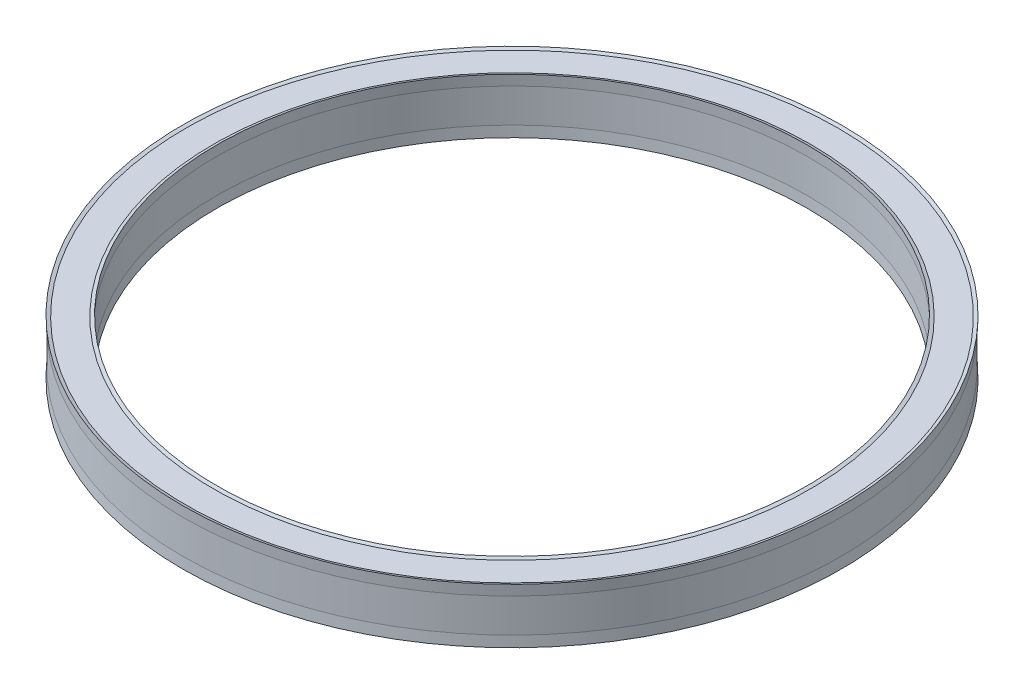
ISO-10303-21;
HEADER;
FILE_DESCRIPTION(('STEP AP214'),'2;1');
FILE_NAME('part.step','',(''),(''),'','','');
FILE_SCHEMA(('AUTOMOTIVE_DESIGN { 1 0 10303 214 1 1 1 1 }'));
ENDSEC;
DATA;
#1=APPLICATION_CONTEXT('core data for automotive mechanical design processes');
#2=APPLICATION_PROTOCOL_DEFINITION('international standard','automotive_design',2000,#1);
#3=PRODUCT_CONTEXT('',#1,'mechanical');
#4=PRODUCT('Part','Part','',(#3));
#5=PRODUCT_RELATED_PRODUCT_CATEGORY('part','',(#4));
#6=PRODUCT_DEFINITION_FORMATION('','',#4);
#7=PRODUCT_DEFINITION_CONTEXT('part definition',#1,'design');
#8=PRODUCT_DEFINITION('design','',#6,#7);
#9=PRODUCT_DEFINITION_SHAPE('','',#8);
#10=(LENGTH_UNIT() NAMED_UNIT(*) SI_UNIT(.MILLI.,.METRE.));
#11=(NAMED_UNIT(*) PLANE_ANGLE_UNIT() SI_UNIT($,.RADIAN.));
#12=(NAMED_UNIT(*) SI_UNIT($,.STERADIAN.) SOLID_ANGLE_UNIT());
#13=UNCERTAINTY_MEASURE_WITH_UNIT(LENGTH_MEASURE(1.E-05),#10,'distance_accuracy_value','');
#14=(GEOMETRIC_REPRESENTATION_CONTEXT(3) GLOBAL_UNCERTAINTY_ASSIGNED_CONTEXT((#13)) GLOBAL_UNIT_ASSIGNED_CONTEXT((#10,
#11,#12)) REPRESENTATION_CONTEXT('',''));
#15=CARTESIAN_POINT('',(0.,0.,0.));
#16=DIRECTION('',(0.,0.,1.));
#17=DIRECTION('',(1.,0.,0.));
#18=AXIS2_PLACEMENT_3D('',#15,#16,#17);
#19=CARTESIAN_POINT('',(0.,6.223,0.));
#20=DIRECTION('',(0.,-1.,0.));
#21=DIRECTION('',(0.,0.,-1.));
#22=AXIS2_PLACEMENT_3D('',#19,#20,#21);
#23=CONICAL_SURFACE('',#22,34.51225,1.24904577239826);
#24=CARTESIAN_POINT('',(0.,6.35,0.));
#25=DIRECTION('',(0.,-1.,0.));
#26=DIRECTION('',(0.,0.,-1.));
#27=AXIS2_PLACEMENT_3D('',#24,#25,#26);
#28=CIRCLE('',#27,34.13125);
#29=CARTESIAN_POINT('',(0.,6.35,-34.13125));
#30=VERTEX_POINT('',#29);
#31=EDGE_CURVE('E68',#30,#30,#28,.T.);
#32=ORIENTED_EDGE('',*,*,#31,.T.);
#33=EDGE_LOOP('',(#32));
#34=FACE_BOUND('',#33,.T.);
#35=CARTESIAN_POINT('',(0.,6.223,0.));
#36=DIRECTION('',(0.,-1.,0.));
#37=DIRECTION('',(0.,0.,-1.));
#38=AXIS2_PLACEMENT_3D('',#35,#36,#37);
#39=CIRCLE('',#38,34.51225);
#40=CARTESIAN_POINT('',(0.,6.223,-34.51225));
#41=VERTEX_POINT('',#40);
#42=EDGE_CURVE('E10',#41,#41,#39,.T.);
#43=ORIENTED_EDGE('',*,*,#42,.F.);
#44=EDGE_LOOP('',(#43));
#45=FACE_BOUND('',#44,.T.);
#46=ADVANCED_FACE('F28',(#34,#45),#23,.T.);
#47=CARTESIAN_POINT('',(34.51225,6.223,0.));
#48=DIRECTION('',(0.,1.,0.));
#49=DIRECTION('',(0.,0.,1.));
#50=AXIS2_PLACEMENT_3D('',#47,#48,#49);
#51=PLANE('',#50);
#52=ORIENTED_EDGE('',*,*,#42,.T.);
#53=EDGE_LOOP('',(#52));
#54=FACE_BOUND('',#53,.T.);
#55=CARTESIAN_POINT('',(0.,6.223,0.));
#56=DIRECTION('',(0.,-1.,0.));
#57=DIRECTION('',(0.,0.,-1.));
#58=AXIS2_PLACEMENT_3D('',#55,#56,#57);
#59=CIRCLE('',#58,37.719);
#60=CARTESIAN_POINT('',(0.,6.223,-37.719));
#61=VERTEX_POINT('',#60);
#62=EDGE_CURVE('E34',#61,#61,#59,.T.);
#63=ORIENTED_EDGE('',*,*,#62,.F.);
#64=EDGE_LOOP('',(#63));
#65=FACE_BOUND('',#64,.T.);
#66=ADVANCED_FACE('F86',(#54,#65),#51,.T.);
#67=CARTESIAN_POINT('',(0.,6.35,0.));
#68=DIRECTION('',(0.,1.,0.));
#69=DIRECTION('',(0.,0.,1.));
#70=AXIS2_PLACEMENT_3D('',#67,#68,#69);
#71=CONICAL_SURFACE('',#70,38.1,1.24904577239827);
#72=ORIENTED_EDGE('',*,*,#62,.T.);
#73=EDGE_LOOP('',(#72));
#74=FACE_BOUND('',#73,.T.);
#75=CARTESIAN_POINT('',(0.,6.35,0.));
#76=DIRECTION('',(0.,-1.,0.));
#77=DIRECTION('',(0.,0.,-1.));
#78=AXIS2_PLACEMENT_3D('',#75,#76,#77);
#79=CIRCLE('',#78,38.1);
#80=CARTESIAN_POINT('',(0.,6.35,-38.1));
#81=VERTEX_POINT('',#80);
#82=EDGE_CURVE('E38',#81,#81,#79,.T.);
#83=ORIENTED_EDGE('',*,*,#82,.F.);
#84=EDGE_LOOP('',(#83));
#85=FACE_BOUND('',#84,.T.);
#86=ADVANCED_FACE('F90',(#74,#85),#71,.F.);
#87=CARTESIAN_POINT('',(0.,5.1308,0.));
#88=DIRECTION('',(0.,1.,0.));
#89=DIRECTION('',(0.,0.,1.));
#90=AXIS2_PLACEMENT_3D('',#87,#88,#89);
#91=CONICAL_SURFACE('',#90,38.0365,0.0520363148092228);
#92=ORIENTED_EDGE('',*,*,#82,.T.);
#93=EDGE_LOOP('',(#92));
#94=FACE_BOUND('',#93,.T.);
#95=CARTESIAN_POINT('',(0.,5.1308,0.));
#96=DIRECTION('',(0.,-1.,0.));
#97=DIRECTION('',(0.,0.,-1.));
#98=AXIS2_PLACEMENT_3D('',#95,#96,#97);
#99=CIRCLE('',#98,38.0365);
#100=CARTESIAN_POINT('',(0.,5.1308,-38.0365));
#101=VERTEX_POINT('',#100);
#102=EDGE_CURVE('E42',#101,#101,#99,.T.);
#103=ORIENTED_EDGE('',*,*,#102,.F.);
#104=EDGE_LOOP('',(#103));
#105=FACE_BOUND('',#104,.T.);
#106=ADVANCED_FACE('F94',(#94,#105),#91,.T.);
#107=CARTESIAN_POINT('',(0.,0.,0.));
#108=DIRECTION('',(0.,-1.,0.));
#109=DIRECTION('',(0.,0.,-1.));
#110=AXIS2_PLACEMENT_3D('',#107,#108,#109);
#111=CYLINDRICAL_SURFACE('',#110,38.0365);
#112=ORIENTED_EDGE('',*,*,#102,.T.);
#113=EDGE_LOOP('',(#112));
#114=FACE_BOUND('',#113,.T.);
#115=CARTESIAN_POINT('',(0.,1.2192,0.));
#116=DIRECTION('',(0.,-1.,0.));
#117=DIRECTION('',(0.,0.,-1.));
#118=AXIS2_PLACEMENT_3D('',#115,#116,#117);
#119=CIRCLE('',#118,38.0365);
#120=CARTESIAN_POINT('',(0.,1.2192,-38.0365));
#121=VERTEX_POINT('',#120);
#122=EDGE_CURVE('E47',#121,#121,#119,.T.);
#123=ORIENTED_EDGE('',*,*,#122,.F.);
#124=EDGE_LOOP('',(#123));
#125=FACE_BOUND('',#124,.T.);
#126=ADVANCED_FACE('F100',(#114,#125),#111,.T.);
#127=CARTESIAN_POINT('',(0.,0.,0.));
#128=DIRECTION('',(0.,-1.,0.));
#129=DIRECTION('',(0.,0.,-1.));
#130=AXIS2_PLACEMENT_3D('',#127,#128,#129);
#131=CONICAL_SURFACE('',#130,38.1,0.0520363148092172);
#132=ORIENTED_EDGE('',*,*,#122,.T.);
#133=EDGE_LOOP('',(#132));
#134=FACE_BOUND('',#133,.T.);
#135=CARTESIAN_POINT('',(0.,0.,0.));
#136=DIRECTION('',(0.,-1.,0.));
#137=DIRECTION('',(0.,0.,-1.));
#138=AXIS2_PLACEMENT_3D('',#135,#136,#137);
#139=CIRCLE('',#138,38.1);
#140=CARTESIAN_POINT('',(0.,0.,-38.1));
#141=VERTEX_POINT('',#140);
#142=EDGE_CURVE('E50',#141,#141,#139,.T.);
#143=ORIENTED_EDGE('',*,*,#142,.F.);
#144=EDGE_LOOP('',(#143));
#145=FACE_BOUND('',#144,.T.);
#146=ADVANCED_FACE('F104',(#134,#145),#131,.T.);
#147=CARTESIAN_POINT('',(0.,0.127,0.));
#148=DIRECTION('',(0.,-1.,0.));
#149=DIRECTION('',(0.,0.,-1.));
#150=AXIS2_PLACEMENT_3D('',#147,#148,#149);
#151=CONICAL_SURFACE('',#150,37.719,1.24904577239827);
#152=ORIENTED_EDGE('',*,*,#142,.T.);
#153=EDGE_LOOP('',(#152));
#154=FACE_BOUND('',#153,.T.);
#155=CARTESIAN_POINT('',(0.,0.127,0.));
#156=DIRECTION('',(0.,-1.,0.));
#157=DIRECTION('',(0.,0.,-1.));
#158=AXIS2_PLACEMENT_3D('',#155,#156,#157);
#159=CIRCLE('',#158,37.719);
#160=CARTESIAN_POINT('',(0.,0.127,-37.719));
#161=VERTEX_POINT('',#160);
#162=EDGE_CURVE('E53',#161,#161,#159,.T.);
#163=ORIENTED_EDGE('',*,*,#162,.F.);
#164=EDGE_LOOP('',(#163));
#165=FACE_BOUND('',#164,.T.);
#166=ADVANCED_FACE('F108',(#154,#165),#151,.F.);
#167=CARTESIAN_POINT('',(34.51225,0.127,0.));
#168=DIRECTION('',(0.,-1.,0.));
#169=DIRECTION('',(0.,0.,-1.));
#170=AXIS2_PLACEMENT_3D('',#167,#168,#169);
#171=PLANE('',#170);
#172=ORIENTED_EDGE('',*,*,#162,.T.);
#173=EDGE_LOOP('',(#172));
#174=FACE_BOUND('',#173,.T.);
#175=CARTESIAN_POINT('',(0.,0.127,0.));
#176=DIRECTION('',(0.,-1.,0.));
#177=DIRECTION('',(0.,0.,-1.));
#178=AXIS2_PLACEMENT_3D('',#175,#176,#177);
#179=CIRCLE('',#178,34.51225);
#180=CARTESIAN_POINT('',(0.,0.127,-34.51225));
#181=VERTEX_POINT('',#180);
#182=EDGE_CURVE('E56',#181,#181,#179,.T.);
#183=ORIENTED_EDGE('',*,*,#182,.F.);
#184=EDGE_LOOP('',(#183));
#185=FACE_BOUND('',#184,.T.);
#186=ADVANCED_FACE('F112',(#174,#185),#171,.T.);
#187=CARTESIAN_POINT('',(0.,0.,0.));
#188=DIRECTION('',(0.,1.,0.));
#189=DIRECTION('',(0.,0.,1.));
#190=AXIS2_PLACEMENT_3D('',#187,#188,#189);
#191=CONICAL_SURFACE('',#190,34.13125,1.24904577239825);
#192=ORIENTED_EDGE('',*,*,#182,.T.);
#193=EDGE_LOOP('',(#192));
#194=FACE_BOUND('',#193,.T.);
#195=CARTESIAN_POINT('',(0.,0.,0.));
#196=DIRECTION('',(0.,-1.,0.));
#197=DIRECTION('',(0.,0.,-1.));
#198=AXIS2_PLACEMENT_3D('',#195,#196,#197);
#199=CIRCLE('',#198,34.13125);
#200=CARTESIAN_POINT('',(0.,0.,-34.13125));
#201=VERTEX_POINT('',#200);
#202=EDGE_CURVE('E59',#201,#201,#199,.T.);
#203=ORIENTED_EDGE('',*,*,#202,.F.);
#204=EDGE_LOOP('',(#203));
#205=FACE_BOUND('',#204,.T.);
#206=ADVANCED_FACE('F116',(#194,#205),#191,.T.);
#207=CARTESIAN_POINT('',(0.,1.2192,0.));
#208=DIRECTION('',(0.,1.,0.));
#209=DIRECTION('',(0.,0.,1.));
#210=AXIS2_PLACEMENT_3D('',#207,#208,#209);
#211=CONICAL_SURFACE('',#210,34.19475,0.0520363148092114);
#212=ORIENTED_EDGE('',*,*,#202,.T.);
#213=EDGE_LOOP('',(#212));
#214=FACE_BOUND('',#213,.T.);
#215=CARTESIAN_POINT('',(0.,1.2192,0.));
#216=DIRECTION('',(0.,-1.,0.));
#217=DIRECTION('',(0.,0.,-1.));
#218=AXIS2_PLACEMENT_3D('',#215,#216,#217);
#219=CIRCLE('',#218,34.19475);
#220=CARTESIAN_POINT('',(0.,1.2192,-34.19475));
#221=VERTEX_POINT('',#220);
#222=EDGE_CURVE('E62',#221,#221,#219,.T.);
#223=ORIENTED_EDGE('',*,*,#222,.F.);
#224=EDGE_LOOP('',(#223));
#225=FACE_BOUND('',#224,.T.);
#226=ADVANCED_FACE('F82',(#214,#225),#211,.F.);
#227=CARTESIAN_POINT('',(0.,0.,0.));
#228=DIRECTION('',(0.,-1.,0.));
#229=DIRECTION('',(0.,0.,-1.));
#230=AXIS2_PLACEMENT_3D('',#227,#228,#229);
#231=CYLINDRICAL_SURFACE('',#230,34.19475);
#232=ORIENTED_EDGE('',*,*,#222,.T.);
#233=EDGE_LOOP('',(#232));
#234=FACE_BOUND('',#233,.T.);
#235=CARTESIAN_POINT('',(0.,5.1308,0.));
#236=DIRECTION('',(0.,-1.,0.));
#237=DIRECTION('',(0.,0.,-1.));
#238=AXIS2_PLACEMENT_3D('',#235,#236,#237);
#239=CIRCLE('',#238,34.19475);
#240=CARTESIAN_POINT('',(0.,5.1308,-34.19475));
#241=VERTEX_POINT('',#240);
#242=EDGE_CURVE('E65',#241,#241,#239,.T.);
#243=ORIENTED_EDGE('',*,*,#242,.F.);
#244=EDGE_LOOP('',(#243));
#245=FACE_BOUND('',#244,.T.);
#246=ADVANCED_FACE('F76',(#234,#245),#231,.F.);
#247=CARTESIAN_POINT('',(0.,6.35,0.));
#248=DIRECTION('',(0.,-1.,0.));
#249=DIRECTION('',(0.,0.,-1.));
#250=AXIS2_PLACEMENT_3D('',#247,#248,#249);
#251=CONICAL_SURFACE('',#250,34.13125,0.0520363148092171);
#252=ORIENTED_EDGE('',*,*,#242,.T.);
#253=EDGE_LOOP('',(#252));
#254=FACE_BOUND('',#253,.T.);
#255=ORIENTED_EDGE('',*,*,#31,.F.);
#256=EDGE_LOOP('',(#255));
#257=FACE_BOUND('',#256,.T.);
#258=ADVANCED_FACE('F74',(#254,#257),#251,.F.);
#259=CLOSED_SHELL('',(#46,#66,#86,#106,#126,#146,#166,#186,#206,#226,#246,#258));
#260=MANIFOLD_SOLID_BREP('B2',#259);
#261=ADVANCED_BREP_SHAPE_REPRESENTATION('',(#18,#260),#14);
#262=SHAPE_DEFINITION_REPRESENTATION(#9,#261);
ENDSEC;
END-ISO-10303-21;
